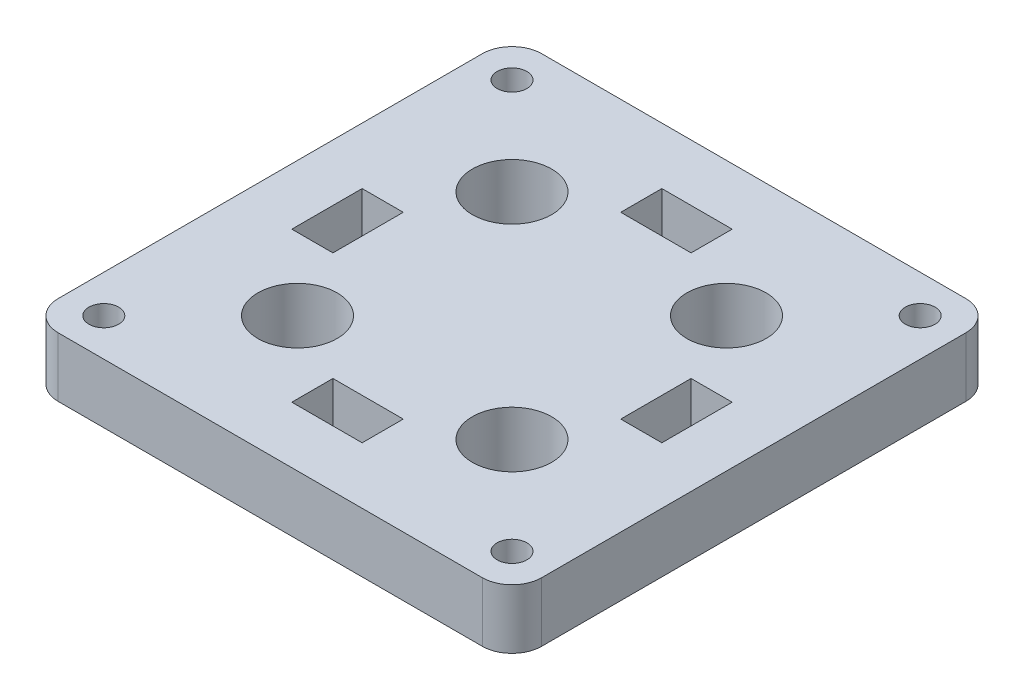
ISO-10303-21;
HEADER;
FILE_DESCRIPTION(('STEP AP214'),'2;1');
FILE_NAME('part.step','',(''),(''),'','','');
FILE_SCHEMA(('AUTOMOTIVE_DESIGN { 1 0 10303 214 1 1 1 1 }'));
ENDSEC;
DATA;
#1=APPLICATION_CONTEXT('core data for automotive mechanical design processes');
#2=APPLICATION_PROTOCOL_DEFINITION('international standard','automotive_design',2000,#1);
#3=PRODUCT_CONTEXT('',#1,'mechanical');
#4=PRODUCT('Part','Part','',(#3));
#5=PRODUCT_RELATED_PRODUCT_CATEGORY('part','',(#4));
#6=PRODUCT_DEFINITION_FORMATION('','',#4);
#7=PRODUCT_DEFINITION_CONTEXT('part definition',#1,'design');
#8=PRODUCT_DEFINITION('design','',#6,#7);
#9=PRODUCT_DEFINITION_SHAPE('','',#8);
#10=(LENGTH_UNIT() NAMED_UNIT(*) SI_UNIT(.MILLI.,.METRE.));
#11=(NAMED_UNIT(*) PLANE_ANGLE_UNIT() SI_UNIT($,.RADIAN.));
#12=(NAMED_UNIT(*) SI_UNIT($,.STERADIAN.) SOLID_ANGLE_UNIT());
#13=UNCERTAINTY_MEASURE_WITH_UNIT(LENGTH_MEASURE(1.E-05),#10,'distance_accuracy_value','');
#14=(GEOMETRIC_REPRESENTATION_CONTEXT(3) GLOBAL_UNCERTAINTY_ASSIGNED_CONTEXT((#13)) GLOBAL_UNIT_ASSIGNED_CONTEXT((#10,
#11,#12)) REPRESENTATION_CONTEXT('',''));
#15=CARTESIAN_POINT('',(0.,0.,0.));
#16=DIRECTION('',(0.,0.,1.));
#17=DIRECTION('',(1.,0.,0.));
#18=AXIS2_PLACEMENT_3D('',#15,#16,#17);
#19=CARTESIAN_POINT('',(0.,3.,0.));
#20=DIRECTION('',(0.,1.,0.));
#21=DIRECTION('',(0.,0.,1.));
#22=AXIS2_PLACEMENT_3D('',#19,#20,#21);
#23=PLANE('',#22);
#24=DIRECTION('',(1.,0.,0.));
#25=VECTOR('',#24,1.);
#26=CARTESIAN_POINT('',(-18.675,3.,-3.55));
#27=LINE('',#26,#25);
#28=CARTESIAN_POINT('',(-14.525,3.,-3.55));
#29=VERTEX_POINT('',#28);
#30=CARTESIAN_POINT('',(-18.675,3.,-3.55));
#31=VERTEX_POINT('',#30);
#32=EDGE_CURVE('E409',#29,#31,#27,.F.);
#33=ORIENTED_EDGE('',*,*,#32,.F.);
#34=DIRECTION('',(0.,0.,1.));
#35=VECTOR('',#34,1.);
#36=CARTESIAN_POINT('',(-14.525,3.,-3.55));
#37=LINE('',#36,#35);
#38=CARTESIAN_POINT('',(-14.525,3.,3.55));
#39=VERTEX_POINT('',#38);
#40=EDGE_CURVE('E396',#39,#29,#37,.F.);
#41=ORIENTED_EDGE('',*,*,#40,.F.);
#42=DIRECTION('',(-1.,0.,0.));
#43=VECTOR('',#42,1.);
#44=CARTESIAN_POINT('',(-14.525,3.,3.55));
#45=LINE('',#44,#43);
#46=CARTESIAN_POINT('',(-18.675,3.,3.55));
#47=VERTEX_POINT('',#46);
#48=EDGE_CURVE('E398',#47,#39,#45,.F.);
#49=ORIENTED_EDGE('',*,*,#48,.F.);
#50=DIRECTION('',(0.,0.,-1.));
#51=VECTOR('',#50,1.);
#52=CARTESIAN_POINT('',(-18.675,3.,3.55));
#53=LINE('',#52,#51);
#54=EDGE_CURVE('E402',#31,#47,#53,.F.);
#55=ORIENTED_EDGE('',*,*,#54,.F.);
#56=EDGE_LOOP('',(#33,#41,#49,#55));
#57=FACE_BOUND('',#56,.T.);
#58=DIRECTION('',(-1.,0.,0.));
#59=VECTOR('',#58,1.);
#60=CARTESIAN_POINT('',(3.55,3.,18.675));
#61=LINE('',#60,#59);
#62=CARTESIAN_POINT('',(-3.55,3.,18.675));
#63=VERTEX_POINT('',#62);
#64=CARTESIAN_POINT('',(3.55,3.,18.675));
#65=VERTEX_POINT('',#64);
#66=EDGE_CURVE('E391',#63,#65,#61,.F.);
#67=ORIENTED_EDGE('',*,*,#66,.F.);
#68=DIRECTION('',(0.,0.,-1.));
#69=VECTOR('',#68,1.);
#70=CARTESIAN_POINT('',(-3.55,3.,18.675));
#71=LINE('',#70,#69);
#72=CARTESIAN_POINT('',(-3.55,3.,14.525));
#73=VERTEX_POINT('',#72);
#74=EDGE_CURVE('E375',#73,#63,#71,.F.);
#75=ORIENTED_EDGE('',*,*,#74,.F.);
#76=DIRECTION('',(1.,0.,0.));
#77=VECTOR('',#76,1.);
#78=CARTESIAN_POINT('',(-3.55,3.,14.525));
#79=LINE('',#78,#77);
#80=CARTESIAN_POINT('',(3.55,3.,14.525));
#81=VERTEX_POINT('',#80);
#82=EDGE_CURVE('E377',#81,#73,#79,.F.);
#83=ORIENTED_EDGE('',*,*,#82,.F.);
#84=DIRECTION('',(0.,0.,1.));
#85=VECTOR('',#84,1.);
#86=CARTESIAN_POINT('',(3.55,3.,14.525));
#87=LINE('',#86,#85);
#88=EDGE_CURVE('E382',#65,#81,#87,.F.);
#89=ORIENTED_EDGE('',*,*,#88,.F.);
#90=EDGE_LOOP('',(#67,#75,#83,#89));
#91=FACE_BOUND('',#90,.T.);
#92=DIRECTION('',(0.,0.,-1.));
#93=VECTOR('',#92,1.);
#94=CARTESIAN_POINT('',(14.525,3.,3.55));
#95=LINE('',#94,#93);
#96=CARTESIAN_POINT('',(14.525,3.,-3.55));
#97=VERTEX_POINT('',#96);
#98=CARTESIAN_POINT('',(14.525,3.,3.55));
#99=VERTEX_POINT('',#98);
#100=EDGE_CURVE('E369',#97,#99,#95,.F.);
#101=ORIENTED_EDGE('',*,*,#100,.F.);
#102=DIRECTION('',(1.,0.,0.));
#103=VECTOR('',#102,1.);
#104=CARTESIAN_POINT('',(14.525,3.,-3.55));
#105=LINE('',#104,#103);
#106=CARTESIAN_POINT('',(18.675,3.,-3.55));
#107=VERTEX_POINT('',#106);
#108=EDGE_CURVE('E350',#107,#97,#105,.F.);
#109=ORIENTED_EDGE('',*,*,#108,.F.);
#110=DIRECTION('',(0.,0.,1.));
#111=VECTOR('',#110,1.);
#112=CARTESIAN_POINT('',(18.675,3.,-3.55));
#113=LINE('',#112,#111);
#114=CARTESIAN_POINT('',(18.675,3.,3.55));
#115=VERTEX_POINT('',#114);
#116=EDGE_CURVE('E353',#115,#107,#113,.F.);
#117=ORIENTED_EDGE('',*,*,#116,.F.);
#118=DIRECTION('',(-1.,0.,0.));
#119=VECTOR('',#118,1.);
#120=CARTESIAN_POINT('',(18.675,3.,3.55));
#121=LINE('',#120,#119);
#122=EDGE_CURVE('E359',#99,#115,#121,.F.);
#123=ORIENTED_EDGE('',*,*,#122,.F.);
#124=EDGE_LOOP('',(#101,#109,#117,#123));
#125=FACE_BOUND('',#124,.T.);
#126=DIRECTION('',(0.,0.,-1.));
#127=VECTOR('',#126,1.);
#128=CARTESIAN_POINT('',(-3.55,3.,-14.525));
#129=LINE('',#128,#127);
#130=CARTESIAN_POINT('',(-3.55,3.,-18.675));
#131=VERTEX_POINT('',#130);
#132=CARTESIAN_POINT('',(-3.55,3.,-14.525));
#133=VERTEX_POINT('',#132);
#134=EDGE_CURVE('E345',#131,#133,#129,.F.);
#135=ORIENTED_EDGE('',*,*,#134,.F.);
#136=DIRECTION('',(1.,0.,0.));
#137=VECTOR('',#136,1.);
#138=CARTESIAN_POINT('',(-3.55,3.,-18.675));
#139=LINE('',#138,#137);
#140=CARTESIAN_POINT('',(3.55,3.,-18.675));
#141=VERTEX_POINT('',#140);
#142=EDGE_CURVE('E280',#141,#131,#139,.F.);
#143=ORIENTED_EDGE('',*,*,#142,.F.);
#144=DIRECTION('',(0.,0.,1.));
#145=VECTOR('',#144,1.);
#146=CARTESIAN_POINT('',(3.55,3.,-18.675));
#147=LINE('',#146,#145);
#148=CARTESIAN_POINT('',(3.55,3.,-14.525));
#149=VERTEX_POINT('',#148);
#150=EDGE_CURVE('E329',#149,#141,#147,.F.);
#151=ORIENTED_EDGE('',*,*,#150,.F.);
#152=DIRECTION('',(-1.,0.,0.));
#153=VECTOR('',#152,1.);
#154=CARTESIAN_POINT('',(3.55,3.,-14.525));
#155=LINE('',#154,#153);
#156=EDGE_CURVE('E335',#133,#149,#155,.F.);
#157=ORIENTED_EDGE('',*,*,#156,.F.);
#158=EDGE_LOOP('',(#135,#143,#151,#157));
#159=FACE_BOUND('',#158,.T.);
#160=CARTESIAN_POINT('',(-10.825,3.,-10.825));
#161=DIRECTION('',(0.,1.,0.));
#162=DIRECTION('',(0.,0.,1.));
#163=AXIS2_PLACEMENT_3D('',#160,#161,#162);
#164=CIRCLE('',#163,4.);
#165=CARTESIAN_POINT('',(-10.825,3.,-6.825));
#166=VERTEX_POINT('',#165);
#167=EDGE_CURVE('E277',#166,#166,#164,.F.);
#168=ORIENTED_EDGE('',*,*,#167,.T.);
#169=EDGE_LOOP('',(#168));
#170=FACE_BOUND('',#169,.T.);
#171=CARTESIAN_POINT('',(10.825,3.,-10.825));
#172=DIRECTION('',(0.,1.,0.));
#173=DIRECTION('',(0.,0.,1.));
#174=AXIS2_PLACEMENT_3D('',#171,#172,#173);
#175=CIRCLE('',#174,4.);
#176=CARTESIAN_POINT('',(10.825,3.,-6.825));
#177=VERTEX_POINT('',#176);
#178=EDGE_CURVE('E281',#177,#177,#175,.F.);
#179=ORIENTED_EDGE('',*,*,#178,.T.);
#180=EDGE_LOOP('',(#179));
#181=FACE_BOUND('',#180,.T.);
#182=CARTESIAN_POINT('',(10.825,3.,10.825));
#183=DIRECTION('',(0.,1.,0.));
#184=DIRECTION('',(0.,0.,1.));
#185=AXIS2_PLACEMENT_3D('',#182,#183,#184);
#186=CIRCLE('',#185,4.);
#187=CARTESIAN_POINT('',(10.825,3.,14.825));
#188=VERTEX_POINT('',#187);
#189=EDGE_CURVE('E285',#188,#188,#186,.F.);
#190=ORIENTED_EDGE('',*,*,#189,.T.);
#191=EDGE_LOOP('',(#190));
#192=FACE_BOUND('',#191,.T.);
#193=CARTESIAN_POINT('',(-10.825,3.,10.825));
#194=DIRECTION('',(0.,1.,0.));
#195=DIRECTION('',(0.,0.,1.));
#196=AXIS2_PLACEMENT_3D('',#193,#194,#195);
#197=CIRCLE('',#196,4.);
#198=CARTESIAN_POINT('',(-10.825,3.,14.825));
#199=VERTEX_POINT('',#198);
#200=EDGE_CURVE('E289',#199,#199,#197,.F.);
#201=ORIENTED_EDGE('',*,*,#200,.T.);
#202=EDGE_LOOP('',(#201));
#203=FACE_BOUND('',#202,.T.);
#204=CARTESIAN_POINT('',(-20.6,3.,-20.6));
#205=DIRECTION('',(0.,1.,0.));
#206=DIRECTION('',(0.,0.,1.));
#207=AXIS2_PLACEMENT_3D('',#204,#205,#206);
#208=CIRCLE('',#207,1.5);
#209=CARTESIAN_POINT('',(-20.6,3.,-19.1));
#210=VERTEX_POINT('',#209);
#211=EDGE_CURVE('E292',#210,#210,#208,.F.);
#212=ORIENTED_EDGE('',*,*,#211,.T.);
#213=EDGE_LOOP('',(#212));
#214=FACE_BOUND('',#213,.T.);
#215=CARTESIAN_POINT('',(-20.6,3.,20.6));
#216=DIRECTION('',(0.,1.,0.));
#217=DIRECTION('',(0.,0.,1.));
#218=AXIS2_PLACEMENT_3D('',#215,#216,#217);
#219=CIRCLE('',#218,1.5);
#220=CARTESIAN_POINT('',(-20.6,3.,22.1));
#221=VERTEX_POINT('',#220);
#222=EDGE_CURVE('E295',#221,#221,#219,.F.);
#223=ORIENTED_EDGE('',*,*,#222,.T.);
#224=EDGE_LOOP('',(#223));
#225=FACE_BOUND('',#224,.T.);
#226=CARTESIAN_POINT('',(20.6,3.,20.6));
#227=DIRECTION('',(0.,1.,0.));
#228=DIRECTION('',(0.,0.,1.));
#229=AXIS2_PLACEMENT_3D('',#226,#227,#228);
#230=CIRCLE('',#229,1.5);
#231=CARTESIAN_POINT('',(20.6,3.,22.1));
#232=VERTEX_POINT('',#231);
#233=EDGE_CURVE('E298',#232,#232,#230,.F.);
#234=ORIENTED_EDGE('',*,*,#233,.T.);
#235=EDGE_LOOP('',(#234));
#236=FACE_BOUND('',#235,.T.);
#237=CARTESIAN_POINT('',(20.6,3.,-20.6));
#238=DIRECTION('',(0.,1.,0.));
#239=DIRECTION('',(0.,0.,1.));
#240=AXIS2_PLACEMENT_3D('',#237,#238,#239);
#241=CIRCLE('',#240,1.5);
#242=CARTESIAN_POINT('',(20.6,3.,-19.1));
#243=VERTEX_POINT('',#242);
#244=EDGE_CURVE('E302',#243,#243,#241,.F.);
#245=ORIENTED_EDGE('',*,*,#244,.T.);
#246=EDGE_LOOP('',(#245));
#247=FACE_BOUND('',#246,.T.);
#248=DIRECTION('',(-1.,0.,0.));
#249=VECTOR('',#248,1.);
#250=CARTESIAN_POINT('',(21.4,3.,-24.4));
#251=LINE('',#250,#249);
#252=CARTESIAN_POINT('',(-21.4,3.,-24.4));
#253=VERTEX_POINT('',#252);
#254=CARTESIAN_POINT('',(21.4,3.,-24.4));
#255=VERTEX_POINT('',#254);
#256=EDGE_CURVE('E209',#253,#255,#251,.F.);
#257=ORIENTED_EDGE('',*,*,#256,.F.);
#258=CARTESIAN_POINT('',(-21.4,3.,-21.4));
#259=DIRECTION('',(0.,1.,0.));
#260=DIRECTION('',(0.,0.,1.));
#261=AXIS2_PLACEMENT_3D('',#258,#259,#260);
#262=CIRCLE('',#261,3.);
#263=CARTESIAN_POINT('',(-24.4,3.,-21.4));
#264=VERTEX_POINT('',#263);
#265=EDGE_CURVE('E20',#264,#253,#262,.F.);
#266=ORIENTED_EDGE('',*,*,#265,.F.);
#267=DIRECTION('',(0.,0.,1.));
#268=VECTOR('',#267,1.);
#269=CARTESIAN_POINT('',(-24.4,3.,-21.4));
#270=LINE('',#269,#268);
#271=CARTESIAN_POINT('',(-24.4,3.,21.4));
#272=VERTEX_POINT('',#271);
#273=EDGE_CURVE('E195',#272,#264,#270,.F.);
#274=ORIENTED_EDGE('',*,*,#273,.F.);
#275=CARTESIAN_POINT('',(-21.4,3.,21.4));
#276=DIRECTION('',(0.,1.,0.));
#277=DIRECTION('',(0.,0.,1.));
#278=AXIS2_PLACEMENT_3D('',#275,#276,#277);
#279=CIRCLE('',#278,3.);
#280=CARTESIAN_POINT('',(-21.4,3.,24.4));
#281=VERTEX_POINT('',#280);
#282=EDGE_CURVE('E216',#281,#272,#279,.F.);
#283=ORIENTED_EDGE('',*,*,#282,.F.);
#284=DIRECTION('',(1.,0.,0.));
#285=VECTOR('',#284,1.);
#286=CARTESIAN_POINT('',(-21.4,3.,24.4));
#287=LINE('',#286,#285);
#288=CARTESIAN_POINT('',(21.4,3.,24.4));
#289=VERTEX_POINT('',#288);
#290=EDGE_CURVE('E230',#289,#281,#287,.F.);
#291=ORIENTED_EDGE('',*,*,#290,.F.);
#292=CARTESIAN_POINT('',(21.4,3.,21.4));
#293=DIRECTION('',(0.,1.,0.));
#294=DIRECTION('',(0.,0.,1.));
#295=AXIS2_PLACEMENT_3D('',#292,#293,#294);
#296=CIRCLE('',#295,3.);
#297=CARTESIAN_POINT('',(24.4,3.,21.4));
#298=VERTEX_POINT('',#297);
#299=EDGE_CURVE('E310',#298,#289,#296,.F.);
#300=ORIENTED_EDGE('',*,*,#299,.F.);
#301=DIRECTION('',(0.,0.,-1.));
#302=VECTOR('',#301,1.);
#303=CARTESIAN_POINT('',(24.4,3.,21.4));
#304=LINE('',#303,#302);
#305=CARTESIAN_POINT('',(24.4,3.,-21.4));
#306=VERTEX_POINT('',#305);
#307=EDGE_CURVE('E225',#306,#298,#304,.F.);
#308=ORIENTED_EDGE('',*,*,#307,.F.);
#309=CARTESIAN_POINT('',(21.4,3.,-21.4));
#310=DIRECTION('',(0.,1.,0.));
#311=DIRECTION('',(0.,0.,1.));
#312=AXIS2_PLACEMENT_3D('',#309,#310,#311);
#313=CIRCLE('',#312,3.);
#314=EDGE_CURVE('E306',#255,#306,#313,.F.);
#315=ORIENTED_EDGE('',*,*,#314,.F.);
#316=EDGE_LOOP('',(#257,#266,#274,#283,#291,#300,#308,#315));
#317=FACE_BOUND('',#316,.T.);
#318=ADVANCED_FACE('F17',(#57,#91,#125,#159,#170,#181,#192,#203,#214,#225,#236,#247,#317),#23,.T.);
#319=CARTESIAN_POINT('',(-21.4,-3.,-21.4));
#320=DIRECTION('',(0.,1.,0.));
#321=DIRECTION('',(0.,0.,1.));
#322=AXIS2_PLACEMENT_3D('',#319,#320,#321);
#323=CYLINDRICAL_SURFACE('',#322,3.);
#324=DIRECTION('',(0.,1.,0.));
#325=VECTOR('',#324,1.);
#326=CARTESIAN_POINT('',(-21.4,-3.,-24.4));
#327=LINE('',#326,#325);
#328=CARTESIAN_POINT('',(-21.4,-3.,-24.4));
#329=VERTEX_POINT('',#328);
#330=EDGE_CURVE('E224',#329,#253,#327,.T.);
#331=ORIENTED_EDGE('',*,*,#330,.F.);
#332=CARTESIAN_POINT('',(-21.4,-3.,-21.4));
#333=DIRECTION('',(0.,1.,0.));
#334=DIRECTION('',(0.,0.,1.));
#335=AXIS2_PLACEMENT_3D('',#332,#333,#334);
#336=CIRCLE('',#335,3.);
#337=CARTESIAN_POINT('',(-24.4,-3.,-21.4));
#338=VERTEX_POINT('',#337);
#339=EDGE_CURVE('E215',#329,#338,#336,.T.);
#340=ORIENTED_EDGE('',*,*,#339,.T.);
#341=DIRECTION('',(0.,1.,0.));
#342=VECTOR('',#341,1.);
#343=CARTESIAN_POINT('',(-24.4,-3.,-21.4));
#344=LINE('',#343,#342);
#345=EDGE_CURVE('E200',#264,#338,#344,.F.);
#346=ORIENTED_EDGE('',*,*,#345,.F.);
#347=ORIENTED_EDGE('',*,*,#265,.T.);
#348=EDGE_LOOP('',(#331,#340,#346,#347));
#349=FACE_BOUND('',#348,.T.);
#350=ADVANCED_FACE('F214',(#349),#323,.T.);
#351=CARTESIAN_POINT('',(-24.4,-3.,-21.4));
#352=DIRECTION('',(-1.,0.,0.));
#353=DIRECTION('',(0.,0.,1.));
#354=AXIS2_PLACEMENT_3D('',#351,#352,#353);
#355=PLANE('',#354);
#356=ORIENTED_EDGE('',*,*,#345,.T.);
#357=DIRECTION('',(0.,0.,1.));
#358=VECTOR('',#357,1.);
#359=CARTESIAN_POINT('',(-24.4,-3.,0.));
#360=LINE('',#359,#358);
#361=CARTESIAN_POINT('',(-24.4,-3.,21.4));
#362=VERTEX_POINT('',#361);
#363=EDGE_CURVE('E275',#338,#362,#360,.T.);
#364=ORIENTED_EDGE('',*,*,#363,.T.);
#365=DIRECTION('',(0.,1.,0.));
#366=VECTOR('',#365,1.);
#367=CARTESIAN_POINT('',(-24.4,-3.,21.4));
#368=LINE('',#367,#366);
#369=EDGE_CURVE('E202',#272,#362,#368,.F.);
#370=ORIENTED_EDGE('',*,*,#369,.F.);
#371=ORIENTED_EDGE('',*,*,#273,.T.);
#372=EDGE_LOOP('',(#356,#364,#370,#371));
#373=FACE_BOUND('',#372,.T.);
#374=ADVANCED_FACE('F197',(#373),#355,.T.);
#375=CARTESIAN_POINT('',(-21.4,-3.,21.4));
#376=DIRECTION('',(0.,1.,0.));
#377=DIRECTION('',(0.,0.,1.));
#378=AXIS2_PLACEMENT_3D('',#375,#376,#377);
#379=CYLINDRICAL_SURFACE('',#378,3.);
#380=ORIENTED_EDGE('',*,*,#369,.T.);
#381=CARTESIAN_POINT('',(-21.4,-3.,21.4));
#382=DIRECTION('',(0.,1.,0.));
#383=DIRECTION('',(0.,0.,1.));
#384=AXIS2_PLACEMENT_3D('',#381,#382,#383);
#385=CIRCLE('',#384,3.);
#386=CARTESIAN_POINT('',(-21.4,-3.,24.4));
#387=VERTEX_POINT('',#386);
#388=EDGE_CURVE('E272',#362,#387,#385,.T.);
#389=ORIENTED_EDGE('',*,*,#388,.T.);
#390=DIRECTION('',(0.,1.,0.));
#391=VECTOR('',#390,1.);
#392=CARTESIAN_POINT('',(-21.4,-3.,24.4));
#393=LINE('',#392,#391);
#394=EDGE_CURVE('E231',#281,#387,#393,.F.);
#395=ORIENTED_EDGE('',*,*,#394,.F.);
#396=ORIENTED_EDGE('',*,*,#282,.T.);
#397=EDGE_LOOP('',(#380,#389,#395,#396));
#398=FACE_BOUND('',#397,.T.);
#399=ADVANCED_FACE('F603',(#398),#379,.T.);
#400=CARTESIAN_POINT('',(-21.4,-3.,24.4));
#401=DIRECTION('',(0.,0.,1.));
#402=DIRECTION('',(1.,0.,0.));
#403=AXIS2_PLACEMENT_3D('',#400,#401,#402);
#404=PLANE('',#403);
#405=ORIENTED_EDGE('',*,*,#394,.T.);
#406=DIRECTION('',(1.,0.,0.));
#407=VECTOR('',#406,1.);
#408=CARTESIAN_POINT('',(0.,-3.,24.4));
#409=LINE('',#408,#407);
#410=CARTESIAN_POINT('',(21.4,-3.,24.4));
#411=VERTEX_POINT('',#410);
#412=EDGE_CURVE('E271',#387,#411,#409,.T.);
#413=ORIENTED_EDGE('',*,*,#412,.T.);
#414=DIRECTION('',(0.,1.,0.));
#415=VECTOR('',#414,1.);
#416=CARTESIAN_POINT('',(21.4,-3.,24.4));
#417=LINE('',#416,#415);
#418=EDGE_CURVE('E229',#289,#411,#417,.F.);
#419=ORIENTED_EDGE('',*,*,#418,.F.);
#420=ORIENTED_EDGE('',*,*,#290,.T.);
#421=EDGE_LOOP('',(#405,#413,#419,#420));
#422=FACE_BOUND('',#421,.T.);
#423=ADVANCED_FACE('F600',(#422),#404,.T.);
#424=CARTESIAN_POINT('',(21.4,-3.,21.4));
#425=DIRECTION('',(0.,1.,0.));
#426=DIRECTION('',(0.,0.,1.));
#427=AXIS2_PLACEMENT_3D('',#424,#425,#426);
#428=CYLINDRICAL_SURFACE('',#427,3.);
#429=ORIENTED_EDGE('',*,*,#418,.T.);
#430=CARTESIAN_POINT('',(21.4,-3.,21.4));
#431=DIRECTION('',(0.,1.,0.));
#432=DIRECTION('',(0.,0.,1.));
#433=AXIS2_PLACEMENT_3D('',#430,#431,#432);
#434=CIRCLE('',#433,3.);
#435=CARTESIAN_POINT('',(24.4,-3.,21.4));
#436=VERTEX_POINT('',#435);
#437=EDGE_CURVE('E268',#411,#436,#434,.T.);
#438=ORIENTED_EDGE('',*,*,#437,.T.);
#439=DIRECTION('',(0.,1.,0.));
#440=VECTOR('',#439,1.);
#441=CARTESIAN_POINT('',(24.4,-3.,21.4));
#442=LINE('',#441,#440);
#443=EDGE_CURVE('E228',#298,#436,#442,.F.);
#444=ORIENTED_EDGE('',*,*,#443,.F.);
#445=ORIENTED_EDGE('',*,*,#299,.T.);
#446=EDGE_LOOP('',(#429,#438,#444,#445));
#447=FACE_BOUND('',#446,.T.);
#448=ADVANCED_FACE('F596',(#447),#428,.T.);
#449=CARTESIAN_POINT('',(24.4,-3.,21.4));
#450=DIRECTION('',(1.,0.,0.));
#451=DIRECTION('',(0.,0.,-1.));
#452=AXIS2_PLACEMENT_3D('',#449,#450,#451);
#453=PLANE('',#452);
#454=ORIENTED_EDGE('',*,*,#443,.T.);
#455=DIRECTION('',(0.,0.,1.));
#456=VECTOR('',#455,1.);
#457=CARTESIAN_POINT('',(24.4,-3.,0.));
#458=LINE('',#457,#456);
#459=CARTESIAN_POINT('',(24.4,-3.,-21.4));
#460=VERTEX_POINT('',#459);
#461=EDGE_CURVE('E267',#436,#460,#458,.F.);
#462=ORIENTED_EDGE('',*,*,#461,.T.);
#463=DIRECTION('',(0.,1.,0.));
#464=VECTOR('',#463,1.);
#465=CARTESIAN_POINT('',(24.4,-3.,-21.4));
#466=LINE('',#465,#464);
#467=EDGE_CURVE('E309',#306,#460,#466,.F.);
#468=ORIENTED_EDGE('',*,*,#467,.F.);
#469=ORIENTED_EDGE('',*,*,#307,.T.);
#470=EDGE_LOOP('',(#454,#462,#468,#469));
#471=FACE_BOUND('',#470,.T.);
#472=ADVANCED_FACE('F592',(#471),#453,.T.);
#473=CARTESIAN_POINT('',(21.4,-3.,-21.4));
#474=DIRECTION('',(0.,1.,0.));
#475=DIRECTION('',(0.,0.,1.));
#476=AXIS2_PLACEMENT_3D('',#473,#474,#475);
#477=CYLINDRICAL_SURFACE('',#476,3.);
#478=ORIENTED_EDGE('',*,*,#467,.T.);
#479=CARTESIAN_POINT('',(21.4,-3.,-21.4));
#480=DIRECTION('',(0.,1.,0.));
#481=DIRECTION('',(0.,0.,1.));
#482=AXIS2_PLACEMENT_3D('',#479,#480,#481);
#483=CIRCLE('',#482,3.);
#484=CARTESIAN_POINT('',(21.4,-3.,-24.4));
#485=VERTEX_POINT('',#484);
#486=EDGE_CURVE('E263',#460,#485,#483,.T.);
#487=ORIENTED_EDGE('',*,*,#486,.T.);
#488=DIRECTION('',(0.,1.,0.));
#489=VECTOR('',#488,1.);
#490=CARTESIAN_POINT('',(21.4,-3.,-24.4));
#491=LINE('',#490,#489);
#492=EDGE_CURVE('E223',#255,#485,#491,.F.);
#493=ORIENTED_EDGE('',*,*,#492,.F.);
#494=ORIENTED_EDGE('',*,*,#314,.T.);
#495=EDGE_LOOP('',(#478,#487,#493,#494));
#496=FACE_BOUND('',#495,.T.);
#497=ADVANCED_FACE('F588',(#496),#477,.T.);
#498=CARTESIAN_POINT('',(21.4,-3.,-24.4));
#499=DIRECTION('',(0.,0.,-1.));
#500=DIRECTION('',(-1.,0.,0.));
#501=AXIS2_PLACEMENT_3D('',#498,#499,#500);
#502=PLANE('',#501);
#503=ORIENTED_EDGE('',*,*,#492,.T.);
#504=DIRECTION('',(1.,0.,0.));
#505=VECTOR('',#504,1.);
#506=CARTESIAN_POINT('',(0.,-3.,-24.4));
#507=LINE('',#506,#505);
#508=EDGE_CURVE('E262',#485,#329,#507,.F.);
#509=ORIENTED_EDGE('',*,*,#508,.T.);
#510=ORIENTED_EDGE('',*,*,#330,.T.);
#511=ORIENTED_EDGE('',*,*,#256,.T.);
#512=EDGE_LOOP('',(#503,#509,#510,#511));
#513=FACE_BOUND('',#512,.T.);
#514=ADVANCED_FACE('F584',(#513),#502,.T.);
#515=CARTESIAN_POINT('',(20.6,-3.,-20.6));
#516=DIRECTION('',(0.,1.,0.));
#517=DIRECTION('',(0.,0.,1.));
#518=AXIS2_PLACEMENT_3D('',#515,#516,#517);
#519=CYLINDRICAL_SURFACE('',#518,1.5);
#520=ORIENTED_EDGE('',*,*,#244,.F.);
#521=EDGE_LOOP('',(#520));
#522=FACE_BOUND('',#521,.T.);
#523=CARTESIAN_POINT('',(20.6,-3.,-20.6));
#524=DIRECTION('',(0.,1.,0.));
#525=DIRECTION('',(0.,0.,1.));
#526=AXIS2_PLACEMENT_3D('',#523,#524,#525);
#527=CIRCLE('',#526,1.5);
#528=CARTESIAN_POINT('',(20.6,-3.,-19.1));
#529=VERTEX_POINT('',#528);
#530=EDGE_CURVE('E258',#529,#529,#527,.F.);
#531=ORIENTED_EDGE('',*,*,#530,.T.);
#532=EDGE_LOOP('',(#531));
#533=FACE_BOUND('',#532,.T.);
#534=ADVANCED_FACE('F580',(#522,#533),#519,.F.);
#535=CARTESIAN_POINT('',(20.6,-3.,20.6));
#536=DIRECTION('',(0.,1.,0.));
#537=DIRECTION('',(0.,0.,1.));
#538=AXIS2_PLACEMENT_3D('',#535,#536,#537);
#539=CYLINDRICAL_SURFACE('',#538,1.5);
#540=ORIENTED_EDGE('',*,*,#233,.F.);
#541=EDGE_LOOP('',(#540));
#542=FACE_BOUND('',#541,.T.);
#543=CARTESIAN_POINT('',(20.6,-3.,20.6));
#544=DIRECTION('',(0.,1.,0.));
#545=DIRECTION('',(0.,0.,1.));
#546=AXIS2_PLACEMENT_3D('',#543,#544,#545);
#547=CIRCLE('',#546,1.5);
#548=CARTESIAN_POINT('',(20.6,-3.,22.1));
#549=VERTEX_POINT('',#548);
#550=EDGE_CURVE('E255',#549,#549,#547,.F.);
#551=ORIENTED_EDGE('',*,*,#550,.T.);
#552=EDGE_LOOP('',(#551));
#553=FACE_BOUND('',#552,.T.);
#554=ADVANCED_FACE('F576',(#542,#553),#539,.F.);
#555=CARTESIAN_POINT('',(-20.6,-3.,20.6));
#556=DIRECTION('',(0.,1.,0.));
#557=DIRECTION('',(0.,0.,1.));
#558=AXIS2_PLACEMENT_3D('',#555,#556,#557);
#559=CYLINDRICAL_SURFACE('',#558,1.5);
#560=ORIENTED_EDGE('',*,*,#222,.F.);
#561=EDGE_LOOP('',(#560));
#562=FACE_BOUND('',#561,.T.);
#563=CARTESIAN_POINT('',(-20.6,-3.,20.6));
#564=DIRECTION('',(0.,1.,0.));
#565=DIRECTION('',(0.,0.,1.));
#566=AXIS2_PLACEMENT_3D('',#563,#564,#565);
#567=CIRCLE('',#566,1.5);
#568=CARTESIAN_POINT('',(-20.6,-3.,22.1));
#569=VERTEX_POINT('',#568);
#570=EDGE_CURVE('E252',#569,#569,#567,.F.);
#571=ORIENTED_EDGE('',*,*,#570,.T.);
#572=EDGE_LOOP('',(#571));
#573=FACE_BOUND('',#572,.T.);
#574=ADVANCED_FACE('F572',(#562,#573),#559,.F.);
#575=CARTESIAN_POINT('',(-20.6,-3.,-20.6));
#576=DIRECTION('',(0.,1.,0.));
#577=DIRECTION('',(0.,0.,1.));
#578=AXIS2_PLACEMENT_3D('',#575,#576,#577);
#579=CYLINDRICAL_SURFACE('',#578,1.5);
#580=ORIENTED_EDGE('',*,*,#211,.F.);
#581=EDGE_LOOP('',(#580));
#582=FACE_BOUND('',#581,.T.);
#583=CARTESIAN_POINT('',(-20.6,-3.,-20.6));
#584=DIRECTION('',(0.,1.,0.));
#585=DIRECTION('',(0.,0.,1.));
#586=AXIS2_PLACEMENT_3D('',#583,#584,#585);
#587=CIRCLE('',#586,1.5);
#588=CARTESIAN_POINT('',(-20.6,-3.,-19.1));
#589=VERTEX_POINT('',#588);
#590=EDGE_CURVE('E249',#589,#589,#587,.F.);
#591=ORIENTED_EDGE('',*,*,#590,.T.);
#592=EDGE_LOOP('',(#591));
#593=FACE_BOUND('',#592,.T.);
#594=ADVANCED_FACE('F568',(#582,#593),#579,.F.);
#595=CARTESIAN_POINT('',(-10.825,-3.,10.825));
#596=DIRECTION('',(0.,1.,0.));
#597=DIRECTION('',(0.,0.,1.));
#598=AXIS2_PLACEMENT_3D('',#595,#596,#597);
#599=CYLINDRICAL_SURFACE('',#598,4.);
#600=ORIENTED_EDGE('',*,*,#200,.F.);
#601=EDGE_LOOP('',(#600));
#602=FACE_BOUND('',#601,.T.);
#603=CARTESIAN_POINT('',(-10.825,-3.,10.825));
#604=DIRECTION('',(0.,1.,0.));
#605=DIRECTION('',(0.,0.,1.));
#606=AXIS2_PLACEMENT_3D('',#603,#604,#605);
#607=CIRCLE('',#606,4.);
#608=CARTESIAN_POINT('',(-10.825,-3.,14.825));
#609=VERTEX_POINT('',#608);
#610=EDGE_CURVE('E245',#609,#609,#607,.F.);
#611=ORIENTED_EDGE('',*,*,#610,.T.);
#612=EDGE_LOOP('',(#611));
#613=FACE_BOUND('',#612,.T.);
#614=ADVANCED_FACE('F564',(#602,#613),#599,.F.);
#615=CARTESIAN_POINT('',(10.825,-3.,10.825));
#616=DIRECTION('',(0.,1.,0.));
#617=DIRECTION('',(0.,0.,1.));
#618=AXIS2_PLACEMENT_3D('',#615,#616,#617);
#619=CYLINDRICAL_SURFACE('',#618,4.);
#620=ORIENTED_EDGE('',*,*,#189,.F.);
#621=EDGE_LOOP('',(#620));
#622=FACE_BOUND('',#621,.T.);
#623=CARTESIAN_POINT('',(10.825,-3.,10.825));
#624=DIRECTION('',(0.,1.,0.));
#625=DIRECTION('',(0.,0.,1.));
#626=AXIS2_PLACEMENT_3D('',#623,#624,#625);
#627=CIRCLE('',#626,4.);
#628=CARTESIAN_POINT('',(10.825,-3.,14.825));
#629=VERTEX_POINT('',#628);
#630=EDGE_CURVE('E241',#629,#629,#627,.F.);
#631=ORIENTED_EDGE('',*,*,#630,.T.);
#632=EDGE_LOOP('',(#631));
#633=FACE_BOUND('',#632,.T.);
#634=ADVANCED_FACE('F560',(#622,#633),#619,.F.);
#635=CARTESIAN_POINT('',(10.825,-3.,-10.825));
#636=DIRECTION('',(0.,1.,0.));
#637=DIRECTION('',(0.,0.,1.));
#638=AXIS2_PLACEMENT_3D('',#635,#636,#637);
#639=CYLINDRICAL_SURFACE('',#638,4.);
#640=ORIENTED_EDGE('',*,*,#178,.F.);
#641=EDGE_LOOP('',(#640));
#642=FACE_BOUND('',#641,.T.);
#643=CARTESIAN_POINT('',(10.825,-3.,-10.825));
#644=DIRECTION('',(0.,1.,0.));
#645=DIRECTION('',(0.,0.,1.));
#646=AXIS2_PLACEMENT_3D('',#643,#644,#645);
#647=CIRCLE('',#646,4.);
#648=CARTESIAN_POINT('',(10.825,-3.,-6.825));
#649=VERTEX_POINT('',#648);
#650=EDGE_CURVE('E237',#649,#649,#647,.F.);
#651=ORIENTED_EDGE('',*,*,#650,.T.);
#652=EDGE_LOOP('',(#651));
#653=FACE_BOUND('',#652,.T.);
#654=ADVANCED_FACE('F556',(#642,#653),#639,.F.);
#655=CARTESIAN_POINT('',(-10.825,-3.,-10.825));
#656=DIRECTION('',(0.,1.,0.));
#657=DIRECTION('',(0.,0.,1.));
#658=AXIS2_PLACEMENT_3D('',#655,#656,#657);
#659=CYLINDRICAL_SURFACE('',#658,4.);
#660=ORIENTED_EDGE('',*,*,#167,.F.);
#661=EDGE_LOOP('',(#660));
#662=FACE_BOUND('',#661,.T.);
#663=CARTESIAN_POINT('',(-10.825,-3.,-10.825));
#664=DIRECTION('',(0.,1.,0.));
#665=DIRECTION('',(0.,0.,1.));
#666=AXIS2_PLACEMENT_3D('',#663,#664,#665);
#667=CIRCLE('',#666,4.);
#668=CARTESIAN_POINT('',(-10.825,-3.,-6.825));
#669=VERTEX_POINT('',#668);
#670=EDGE_CURVE('E233',#669,#669,#667,.F.);
#671=ORIENTED_EDGE('',*,*,#670,.T.);
#672=EDGE_LOOP('',(#671));
#673=FACE_BOUND('',#672,.T.);
#674=ADVANCED_FACE('F552',(#662,#673),#659,.F.);
#675=CARTESIAN_POINT('',(-3.55,-3.,-18.675));
#676=DIRECTION('',(0.,0.,1.));
#677=DIRECTION('',(1.,0.,0.));
#678=AXIS2_PLACEMENT_3D('',#675,#676,#677);
#679=PLANE('',#678);
#680=DIRECTION('',(0.,1.,0.));
#681=VECTOR('',#680,1.);
#682=CARTESIAN_POINT('',(-3.55,-3.,-18.675));
#683=LINE('',#682,#681);
#684=CARTESIAN_POINT('',(-3.55,-3.,-18.675));
#685=VERTEX_POINT('',#684);
#686=EDGE_CURVE('E341',#685,#131,#683,.T.);
#687=ORIENTED_EDGE('',*,*,#686,.F.);
#688=DIRECTION('',(1.,0.,0.));
#689=VECTOR('',#688,1.);
#690=CARTESIAN_POINT('',(0.,-3.,-18.675));
#691=LINE('',#690,#689);
#692=CARTESIAN_POINT('',(3.55,-3.,-18.675));
#693=VERTEX_POINT('',#692);
#694=EDGE_CURVE('E236',#685,#693,#691,.T.);
#695=ORIENTED_EDGE('',*,*,#694,.T.);
#696=DIRECTION('',(0.,1.,0.));
#697=VECTOR('',#696,1.);
#698=CARTESIAN_POINT('',(3.55,-3.,-18.675));
#699=LINE('',#698,#697);
#700=EDGE_CURVE('E332',#141,#693,#699,.F.);
#701=ORIENTED_EDGE('',*,*,#700,.F.);
#702=ORIENTED_EDGE('',*,*,#142,.T.);
#703=EDGE_LOOP('',(#687,#695,#701,#702));
#704=FACE_BOUND('',#703,.T.);
#705=ADVANCED_FACE('F548',(#704),#679,.T.);
#706=CARTESIAN_POINT('',(3.55,-3.,-18.675));
#707=DIRECTION('',(-1.,0.,0.));
#708=DIRECTION('',(0.,0.,1.));
#709=AXIS2_PLACEMENT_3D('',#706,#707,#708);
#710=PLANE('',#709);
#711=ORIENTED_EDGE('',*,*,#700,.T.);
#712=DIRECTION('',(0.,0.,1.));
#713=VECTOR('',#712,1.);
#714=CARTESIAN_POINT('',(3.55,-3.,0.));
#715=LINE('',#714,#713);
#716=CARTESIAN_POINT('',(3.55,-3.,-14.525));
#717=VERTEX_POINT('',#716);
#718=EDGE_CURVE('E423',#693,#717,#715,.T.);
#719=ORIENTED_EDGE('',*,*,#718,.T.);
#720=DIRECTION('',(0.,1.,0.));
#721=VECTOR('',#720,1.);
#722=CARTESIAN_POINT('',(3.55,-3.,-14.525));
#723=LINE('',#722,#721);
#724=EDGE_CURVE('E338',#149,#717,#723,.F.);
#725=ORIENTED_EDGE('',*,*,#724,.F.);
#726=ORIENTED_EDGE('',*,*,#150,.T.);
#727=EDGE_LOOP('',(#711,#719,#725,#726));
#728=FACE_BOUND('',#727,.T.);
#729=ADVANCED_FACE('F544',(#728),#710,.T.);
#730=CARTESIAN_POINT('',(3.55,-3.,-14.525));
#731=DIRECTION('',(0.,0.,-1.));
#732=DIRECTION('',(-1.,0.,0.));
#733=AXIS2_PLACEMENT_3D('',#730,#731,#732);
#734=PLANE('',#733);
#735=ORIENTED_EDGE('',*,*,#724,.T.);
#736=DIRECTION('',(1.,0.,0.));
#737=VECTOR('',#736,1.);
#738=CARTESIAN_POINT('',(0.,-3.,-14.525));
#739=LINE('',#738,#737);
#740=CARTESIAN_POINT('',(-3.55,-3.,-14.525));
#741=VERTEX_POINT('',#740);
#742=EDGE_CURVE('E427',#717,#741,#739,.F.);
#743=ORIENTED_EDGE('',*,*,#742,.T.);
#744=DIRECTION('',(0.,1.,0.));
#745=VECTOR('',#744,1.);
#746=CARTESIAN_POINT('',(-3.55,-3.,-14.525));
#747=LINE('',#746,#745);
#748=EDGE_CURVE('E348',#133,#741,#747,.F.);
#749=ORIENTED_EDGE('',*,*,#748,.F.);
#750=ORIENTED_EDGE('',*,*,#156,.T.);
#751=EDGE_LOOP('',(#735,#743,#749,#750));
#752=FACE_BOUND('',#751,.T.);
#753=ADVANCED_FACE('F540',(#752),#734,.T.);
#754=CARTESIAN_POINT('',(-3.55,-3.,-14.525));
#755=DIRECTION('',(1.,0.,0.));
#756=DIRECTION('',(0.,0.,-1.));
#757=AXIS2_PLACEMENT_3D('',#754,#755,#756);
#758=PLANE('',#757);
#759=ORIENTED_EDGE('',*,*,#748,.T.);
#760=DIRECTION('',(0.,0.,1.));
#761=VECTOR('',#760,1.);
#762=CARTESIAN_POINT('',(-3.55,-3.,0.));
#763=LINE('',#762,#761);
#764=EDGE_CURVE('E431',#741,#685,#763,.F.);
#765=ORIENTED_EDGE('',*,*,#764,.T.);
#766=ORIENTED_EDGE('',*,*,#686,.T.);
#767=ORIENTED_EDGE('',*,*,#134,.T.);
#768=EDGE_LOOP('',(#759,#765,#766,#767));
#769=FACE_BOUND('',#768,.T.);
#770=ADVANCED_FACE('F536',(#769),#758,.T.);
#771=CARTESIAN_POINT('',(14.525,-3.,-3.55));
#772=DIRECTION('',(0.,0.,1.));
#773=DIRECTION('',(1.,0.,0.));
#774=AXIS2_PLACEMENT_3D('',#771,#772,#773);
#775=PLANE('',#774);
#776=DIRECTION('',(0.,1.,0.));
#777=VECTOR('',#776,1.);
#778=CARTESIAN_POINT('',(14.525,-3.,-3.55));
#779=LINE('',#778,#777);
#780=CARTESIAN_POINT('',(14.525,-3.,-3.55));
#781=VERTEX_POINT('',#780);
#782=EDGE_CURVE('E365',#781,#97,#779,.T.);
#783=ORIENTED_EDGE('',*,*,#782,.F.);
#784=DIRECTION('',(1.,0.,0.));
#785=VECTOR('',#784,1.);
#786=CARTESIAN_POINT('',(0.,-3.,-3.55));
#787=LINE('',#786,#785);
#788=CARTESIAN_POINT('',(18.675,-3.,-3.55));
#789=VERTEX_POINT('',#788);
#790=EDGE_CURVE('E434',#781,#789,#787,.T.);
#791=ORIENTED_EDGE('',*,*,#790,.T.);
#792=DIRECTION('',(0.,1.,0.));
#793=VECTOR('',#792,1.);
#794=CARTESIAN_POINT('',(18.675,-3.,-3.55));
#795=LINE('',#794,#793);
#796=EDGE_CURVE('E356',#107,#789,#795,.F.);
#797=ORIENTED_EDGE('',*,*,#796,.F.);
#798=ORIENTED_EDGE('',*,*,#108,.T.);
#799=EDGE_LOOP('',(#783,#791,#797,#798));
#800=FACE_BOUND('',#799,.T.);
#801=ADVANCED_FACE('F532',(#800),#775,.T.);
#802=CARTESIAN_POINT('',(18.675,-3.,-3.55));
#803=DIRECTION('',(-1.,0.,0.));
#804=DIRECTION('',(0.,0.,1.));
#805=AXIS2_PLACEMENT_3D('',#802,#803,#804);
#806=PLANE('',#805);
#807=ORIENTED_EDGE('',*,*,#796,.T.);
#808=DIRECTION('',(0.,0.,1.));
#809=VECTOR('',#808,1.);
#810=CARTESIAN_POINT('',(18.675,-3.,0.));
#811=LINE('',#810,#809);
#812=CARTESIAN_POINT('',(18.675,-3.,3.55));
#813=VERTEX_POINT('',#812);
#814=EDGE_CURVE('E438',#789,#813,#811,.T.);
#815=ORIENTED_EDGE('',*,*,#814,.T.);
#816=DIRECTION('',(0.,1.,0.));
#817=VECTOR('',#816,1.);
#818=CARTESIAN_POINT('',(18.675,-3.,3.55));
#819=LINE('',#818,#817);
#820=EDGE_CURVE('E362',#115,#813,#819,.F.);
#821=ORIENTED_EDGE('',*,*,#820,.F.);
#822=ORIENTED_EDGE('',*,*,#116,.T.);
#823=EDGE_LOOP('',(#807,#815,#821,#822));
#824=FACE_BOUND('',#823,.T.);
#825=ADVANCED_FACE('F528',(#824),#806,.T.);
#826=CARTESIAN_POINT('',(18.675,-3.,3.55));
#827=DIRECTION('',(0.,0.,-1.));
#828=DIRECTION('',(-1.,0.,0.));
#829=AXIS2_PLACEMENT_3D('',#826,#827,#828);
#830=PLANE('',#829);
#831=ORIENTED_EDGE('',*,*,#820,.T.);
#832=DIRECTION('',(1.,0.,0.));
#833=VECTOR('',#832,1.);
#834=CARTESIAN_POINT('',(0.,-3.,3.55));
#835=LINE('',#834,#833);
#836=CARTESIAN_POINT('',(14.525,-3.,3.55));
#837=VERTEX_POINT('',#836);
#838=EDGE_CURVE('E442',#813,#837,#835,.F.);
#839=ORIENTED_EDGE('',*,*,#838,.T.);
#840=DIRECTION('',(0.,1.,0.));
#841=VECTOR('',#840,1.);
#842=CARTESIAN_POINT('',(14.525,-3.,3.55));
#843=LINE('',#842,#841);
#844=EDGE_CURVE('E372',#99,#837,#843,.F.);
#845=ORIENTED_EDGE('',*,*,#844,.F.);
#846=ORIENTED_EDGE('',*,*,#122,.T.);
#847=EDGE_LOOP('',(#831,#839,#845,#846));
#848=FACE_BOUND('',#847,.T.);
#849=ADVANCED_FACE('F524',(#848),#830,.T.);
#850=CARTESIAN_POINT('',(14.525,-3.,3.55));
#851=DIRECTION('',(1.,0.,0.));
#852=DIRECTION('',(0.,0.,-1.));
#853=AXIS2_PLACEMENT_3D('',#850,#851,#852);
#854=PLANE('',#853);
#855=ORIENTED_EDGE('',*,*,#844,.T.);
#856=DIRECTION('',(0.,0.,1.));
#857=VECTOR('',#856,1.);
#858=CARTESIAN_POINT('',(14.525,-3.,0.));
#859=LINE('',#858,#857);
#860=EDGE_CURVE('E446',#837,#781,#859,.F.);
#861=ORIENTED_EDGE('',*,*,#860,.T.);
#862=ORIENTED_EDGE('',*,*,#782,.T.);
#863=ORIENTED_EDGE('',*,*,#100,.T.);
#864=EDGE_LOOP('',(#855,#861,#862,#863));
#865=FACE_BOUND('',#864,.T.);
#866=ADVANCED_FACE('F520',(#865),#854,.T.);
#867=CARTESIAN_POINT('',(-3.55,-3.,18.675));
#868=DIRECTION('',(1.,0.,0.));
#869=DIRECTION('',(0.,0.,-1.));
#870=AXIS2_PLACEMENT_3D('',#867,#868,#869);
#871=PLANE('',#870);
#872=DIRECTION('',(0.,1.,0.));
#873=VECTOR('',#872,1.);
#874=CARTESIAN_POINT('',(-3.55,-3.,18.675));
#875=LINE('',#874,#873);
#876=CARTESIAN_POINT('',(-3.55,-3.,18.675));
#877=VERTEX_POINT('',#876);
#878=EDGE_CURVE('E387',#877,#63,#875,.T.);
#879=ORIENTED_EDGE('',*,*,#878,.F.);
#880=DIRECTION('',(0.,0.,1.));
#881=VECTOR('',#880,1.);
#882=CARTESIAN_POINT('',(-3.55,-3.,0.));
#883=LINE('',#882,#881);
#884=CARTESIAN_POINT('',(-3.55,-3.,14.525));
#885=VERTEX_POINT('',#884);
#886=EDGE_CURVE('E450',#877,#885,#883,.F.);
#887=ORIENTED_EDGE('',*,*,#886,.T.);
#888=DIRECTION('',(0.,1.,0.));
#889=VECTOR('',#888,1.);
#890=CARTESIAN_POINT('',(-3.55,-3.,14.525));
#891=LINE('',#890,#889);
#892=EDGE_CURVE('E379',#73,#885,#891,.F.);
#893=ORIENTED_EDGE('',*,*,#892,.F.);
#894=ORIENTED_EDGE('',*,*,#74,.T.);
#895=EDGE_LOOP('',(#879,#887,#893,#894));
#896=FACE_BOUND('',#895,.T.);
#897=ADVANCED_FACE('F516',(#896),#871,.T.);
#898=CARTESIAN_POINT('',(-3.55,-3.,14.525));
#899=DIRECTION('',(0.,0.,1.));
#900=DIRECTION('',(1.,0.,0.));
#901=AXIS2_PLACEMENT_3D('',#898,#899,#900);
#902=PLANE('',#901);
#903=ORIENTED_EDGE('',*,*,#892,.T.);
#904=DIRECTION('',(1.,0.,0.));
#905=VECTOR('',#904,1.);
#906=CARTESIAN_POINT('',(0.,-3.,14.525));
#907=LINE('',#906,#905);
#908=CARTESIAN_POINT('',(3.55,-3.,14.525));
#909=VERTEX_POINT('',#908);
#910=EDGE_CURVE('E454',#885,#909,#907,.T.);
#911=ORIENTED_EDGE('',*,*,#910,.T.);
#912=DIRECTION('',(0.,1.,0.));
#913=VECTOR('',#912,1.);
#914=CARTESIAN_POINT('',(3.55,-3.,14.525));
#915=LINE('',#914,#913);
#916=EDGE_CURVE('E384',#81,#909,#915,.F.);
#917=ORIENTED_EDGE('',*,*,#916,.F.);
#918=ORIENTED_EDGE('',*,*,#82,.T.);
#919=EDGE_LOOP('',(#903,#911,#917,#918));
#920=FACE_BOUND('',#919,.T.);
#921=ADVANCED_FACE('F512',(#920),#902,.T.);
#922=CARTESIAN_POINT('',(3.55,-3.,14.525));
#923=DIRECTION('',(-1.,0.,0.));
#924=DIRECTION('',(0.,0.,1.));
#925=AXIS2_PLACEMENT_3D('',#922,#923,#924);
#926=PLANE('',#925);
#927=ORIENTED_EDGE('',*,*,#916,.T.);
#928=DIRECTION('',(0.,0.,1.));
#929=VECTOR('',#928,1.);
#930=CARTESIAN_POINT('',(3.55,-3.,0.));
#931=LINE('',#930,#929);
#932=CARTESIAN_POINT('',(3.55,-3.,18.675));
#933=VERTEX_POINT('',#932);
#934=EDGE_CURVE('E458',#909,#933,#931,.T.);
#935=ORIENTED_EDGE('',*,*,#934,.T.);
#936=DIRECTION('',(0.,1.,0.));
#937=VECTOR('',#936,1.);
#938=CARTESIAN_POINT('',(3.55,-3.,18.675));
#939=LINE('',#938,#937);
#940=EDGE_CURVE('E393',#65,#933,#939,.F.);
#941=ORIENTED_EDGE('',*,*,#940,.F.);
#942=ORIENTED_EDGE('',*,*,#88,.T.);
#943=EDGE_LOOP('',(#927,#935,#941,#942));
#944=FACE_BOUND('',#943,.T.);
#945=ADVANCED_FACE('F508',(#944),#926,.T.);
#946=CARTESIAN_POINT('',(3.55,-3.,18.675));
#947=DIRECTION('',(0.,0.,-1.));
#948=DIRECTION('',(-1.,0.,0.));
#949=AXIS2_PLACEMENT_3D('',#946,#947,#948);
#950=PLANE('',#949);
#951=ORIENTED_EDGE('',*,*,#940,.T.);
#952=DIRECTION('',(1.,0.,0.));
#953=VECTOR('',#952,1.);
#954=CARTESIAN_POINT('',(0.,-3.,18.675));
#955=LINE('',#954,#953);
#956=EDGE_CURVE('E462',#933,#877,#955,.F.);
#957=ORIENTED_EDGE('',*,*,#956,.T.);
#958=ORIENTED_EDGE('',*,*,#878,.T.);
#959=ORIENTED_EDGE('',*,*,#66,.T.);
#960=EDGE_LOOP('',(#951,#957,#958,#959));
#961=FACE_BOUND('',#960,.T.);
#962=ADVANCED_FACE('F505',(#961),#950,.T.);
#963=CARTESIAN_POINT('',(-14.525,-3.,-3.55));
#964=DIRECTION('',(-1.,0.,0.));
#965=DIRECTION('',(0.,0.,1.));
#966=AXIS2_PLACEMENT_3D('',#963,#964,#965);
#967=PLANE('',#966);
#968=DIRECTION('',(0.,1.,0.));
#969=VECTOR('',#968,1.);
#970=CARTESIAN_POINT('',(-14.525,-3.,-3.55));
#971=LINE('',#970,#969);
#972=CARTESIAN_POINT('',(-14.525,-3.,-3.55));
#973=VERTEX_POINT('',#972);
#974=EDGE_CURVE('E406',#973,#29,#971,.T.);
#975=ORIENTED_EDGE('',*,*,#974,.F.);
#976=DIRECTION('',(0.,0.,1.));
#977=VECTOR('',#976,1.);
#978=CARTESIAN_POINT('',(-14.525,-3.,0.));
#979=LINE('',#978,#977);
#980=CARTESIAN_POINT('',(-14.525,-3.,3.55));
#981=VERTEX_POINT('',#980);
#982=EDGE_CURVE('E466',#973,#981,#979,.T.);
#983=ORIENTED_EDGE('',*,*,#982,.T.);
#984=DIRECTION('',(0.,1.,0.));
#985=VECTOR('',#984,1.);
#986=CARTESIAN_POINT('',(-14.525,-3.,3.55));
#987=LINE('',#986,#985);
#988=EDGE_CURVE('E400',#39,#981,#987,.F.);
#989=ORIENTED_EDGE('',*,*,#988,.F.);
#990=ORIENTED_EDGE('',*,*,#40,.T.);
#991=EDGE_LOOP('',(#975,#983,#989,#990));
#992=FACE_BOUND('',#991,.T.);
#993=ADVANCED_FACE('F488',(#992),#967,.T.);
#994=CARTESIAN_POINT('',(-14.525,-3.,3.55));
#995=DIRECTION('',(0.,0.,-1.));
#996=DIRECTION('',(-1.,0.,0.));
#997=AXIS2_PLACEMENT_3D('',#994,#995,#996);
#998=PLANE('',#997);
#999=ORIENTED_EDGE('',*,*,#988,.T.);
#1000=DIRECTION('',(1.,0.,0.));
#1001=VECTOR('',#1000,1.);
#1002=CARTESIAN_POINT('',(0.,-3.,3.55));
#1003=LINE('',#1002,#1001);
#1004=CARTESIAN_POINT('',(-18.675,-3.,3.55));
#1005=VERTEX_POINT('',#1004);
#1006=EDGE_CURVE('E469',#981,#1005,#1003,.F.);
#1007=ORIENTED_EDGE('',*,*,#1006,.T.);
#1008=DIRECTION('',(0.,1.,0.));
#1009=VECTOR('',#1008,1.);
#1010=CARTESIAN_POINT('',(-18.675,-3.,3.55));
#1011=LINE('',#1010,#1009);
#1012=EDGE_CURVE('E404',#47,#1005,#1011,.F.);
#1013=ORIENTED_EDGE('',*,*,#1012,.F.);
#1014=ORIENTED_EDGE('',*,*,#48,.T.);
#1015=EDGE_LOOP('',(#999,#1007,#1013,#1014));
#1016=FACE_BOUND('',#1015,.T.);
#1017=ADVANCED_FACE('F482',(#1016),#998,.T.);
#1018=CARTESIAN_POINT('',(-18.675,-3.,3.55));
#1019=DIRECTION('',(1.,0.,0.));
#1020=DIRECTION('',(0.,0.,-1.));
#1021=AXIS2_PLACEMENT_3D('',#1018,#1019,#1020);
#1022=PLANE('',#1021);
#1023=ORIENTED_EDGE('',*,*,#1012,.T.);
#1024=DIRECTION('',(0.,0.,1.));
#1025=VECTOR('',#1024,1.);
#1026=CARTESIAN_POINT('',(-18.675,-3.,0.));
#1027=LINE('',#1026,#1025);
#1028=CARTESIAN_POINT('',(-18.675,-3.,-3.55));
#1029=VERTEX_POINT('',#1028);
#1030=EDGE_CURVE('E26',#1005,#1029,#1027,.F.);
#1031=ORIENTED_EDGE('',*,*,#1030,.T.);
#1032=DIRECTION('',(0.,1.,0.));
#1033=VECTOR('',#1032,1.);
#1034=CARTESIAN_POINT('',(-18.675,-3.,-3.55));
#1035=LINE('',#1034,#1033);
#1036=EDGE_CURVE('E34',#31,#1029,#1035,.F.);
#1037=ORIENTED_EDGE('',*,*,#1036,.F.);
#1038=ORIENTED_EDGE('',*,*,#54,.T.);
#1039=EDGE_LOOP('',(#1023,#1031,#1037,#1038));
#1040=FACE_BOUND('',#1039,.T.);
#1041=ADVANCED_FACE('F475',(#1040),#1022,.T.);
#1042=CARTESIAN_POINT('',(-18.675,-3.,-3.55));
#1043=DIRECTION('',(0.,0.,1.));
#1044=DIRECTION('',(1.,0.,0.));
#1045=AXIS2_PLACEMENT_3D('',#1042,#1043,#1044);
#1046=PLANE('',#1045);
#1047=ORIENTED_EDGE('',*,*,#1036,.T.);
#1048=DIRECTION('',(1.,0.,0.));
#1049=VECTOR('',#1048,1.);
#1050=CARTESIAN_POINT('',(0.,-3.,-3.55));
#1051=LINE('',#1050,#1049);
#1052=EDGE_CURVE('E11',#1029,#973,#1051,.T.);
#1053=ORIENTED_EDGE('',*,*,#1052,.T.);
#1054=ORIENTED_EDGE('',*,*,#974,.T.);
#1055=ORIENTED_EDGE('',*,*,#32,.T.);
#1056=EDGE_LOOP('',(#1047,#1053,#1054,#1055));
#1057=FACE_BOUND('',#1056,.T.);
#1058=ADVANCED_FACE('F490',(#1057),#1046,.T.);
#1059=CARTESIAN_POINT('',(0.,-3.,0.));
#1060=DIRECTION('',(0.,1.,0.));
#1061=DIRECTION('',(0.,0.,1.));
#1062=AXIS2_PLACEMENT_3D('',#1059,#1060,#1061);
#1063=PLANE('',#1062);
#1064=ORIENTED_EDGE('',*,*,#1030,.F.);
#1065=ORIENTED_EDGE('',*,*,#1006,.F.);
#1066=ORIENTED_EDGE('',*,*,#982,.F.);
#1067=ORIENTED_EDGE('',*,*,#1052,.F.);
#1068=EDGE_LOOP('',(#1064,#1065,#1066,#1067));
#1069=FACE_BOUND('',#1068,.T.);
#1070=ORIENTED_EDGE('',*,*,#934,.F.);
#1071=ORIENTED_EDGE('',*,*,#910,.F.);
#1072=ORIENTED_EDGE('',*,*,#886,.F.);
#1073=ORIENTED_EDGE('',*,*,#956,.F.);
#1074=EDGE_LOOP('',(#1070,#1071,#1072,#1073));
#1075=FACE_BOUND('',#1074,.T.);
#1076=ORIENTED_EDGE('',*,*,#838,.F.);
#1077=ORIENTED_EDGE('',*,*,#814,.F.);
#1078=ORIENTED_EDGE('',*,*,#790,.F.);
#1079=ORIENTED_EDGE('',*,*,#860,.F.);
#1080=EDGE_LOOP('',(#1076,#1077,#1078,#1079));
#1081=FACE_BOUND('',#1080,.T.);
#1082=ORIENTED_EDGE('',*,*,#742,.F.);
#1083=ORIENTED_EDGE('',*,*,#718,.F.);
#1084=ORIENTED_EDGE('',*,*,#694,.F.);
#1085=ORIENTED_EDGE('',*,*,#764,.F.);
#1086=EDGE_LOOP('',(#1082,#1083,#1084,#1085));
#1087=FACE_BOUND('',#1086,.T.);
#1088=ORIENTED_EDGE('',*,*,#670,.F.);
#1089=EDGE_LOOP('',(#1088));
#1090=FACE_BOUND('',#1089,.T.);
#1091=ORIENTED_EDGE('',*,*,#650,.F.);
#1092=EDGE_LOOP('',(#1091));
#1093=FACE_BOUND('',#1092,.T.);
#1094=ORIENTED_EDGE('',*,*,#630,.F.);
#1095=EDGE_LOOP('',(#1094));
#1096=FACE_BOUND('',#1095,.T.);
#1097=ORIENTED_EDGE('',*,*,#610,.F.);
#1098=EDGE_LOOP('',(#1097));
#1099=FACE_BOUND('',#1098,.T.);
#1100=ORIENTED_EDGE('',*,*,#590,.F.);
#1101=EDGE_LOOP('',(#1100));
#1102=FACE_BOUND('',#1101,.T.);
#1103=ORIENTED_EDGE('',*,*,#570,.F.);
#1104=EDGE_LOOP('',(#1103));
#1105=FACE_BOUND('',#1104,.T.);
#1106=ORIENTED_EDGE('',*,*,#550,.F.);
#1107=EDGE_LOOP('',(#1106));
#1108=FACE_BOUND('',#1107,.T.);
#1109=ORIENTED_EDGE('',*,*,#530,.F.);
#1110=EDGE_LOOP('',(#1109));
#1111=FACE_BOUND('',#1110,.T.);
#1112=ORIENTED_EDGE('',*,*,#486,.F.);
#1113=ORIENTED_EDGE('',*,*,#461,.F.);
#1114=ORIENTED_EDGE('',*,*,#437,.F.);
#1115=ORIENTED_EDGE('',*,*,#412,.F.);
#1116=ORIENTED_EDGE('',*,*,#388,.F.);
#1117=ORIENTED_EDGE('',*,*,#363,.F.);
#1118=ORIENTED_EDGE('',*,*,#339,.F.);
#1119=ORIENTED_EDGE('',*,*,#508,.F.);
#1120=EDGE_LOOP('',(#1112,#1113,#1114,#1115,#1116,#1117,#1118,#1119));
#1121=FACE_BOUND('',#1120,.T.);
#1122=ADVANCED_FACE('F479',(#1069,#1075,#1081,#1087,#1090,#1093,#1096,#1099,#1102,#1105,#1108,
#1111,#1121),#1063,.F.);
#1123=CLOSED_SHELL('',(#318,#350,#374,#399,#423,#448,#472,#497,#514,#534,#554,#574,#594,#614,
#634,#654,#674,#705,#729,#753,#770,#801,#825,#849,#866,#897,#921,#945,#962,#993,#1017,#1041,
#1058,#1122));
#1124=MANIFOLD_SOLID_BREP('B1',#1123);
#1125=ADVANCED_BREP_SHAPE_REPRESENTATION('',(#18,#1124),#14);
#1126=SHAPE_DEFINITION_REPRESENTATION(#9,#1125);
ENDSEC;
END-ISO-10303-21;
